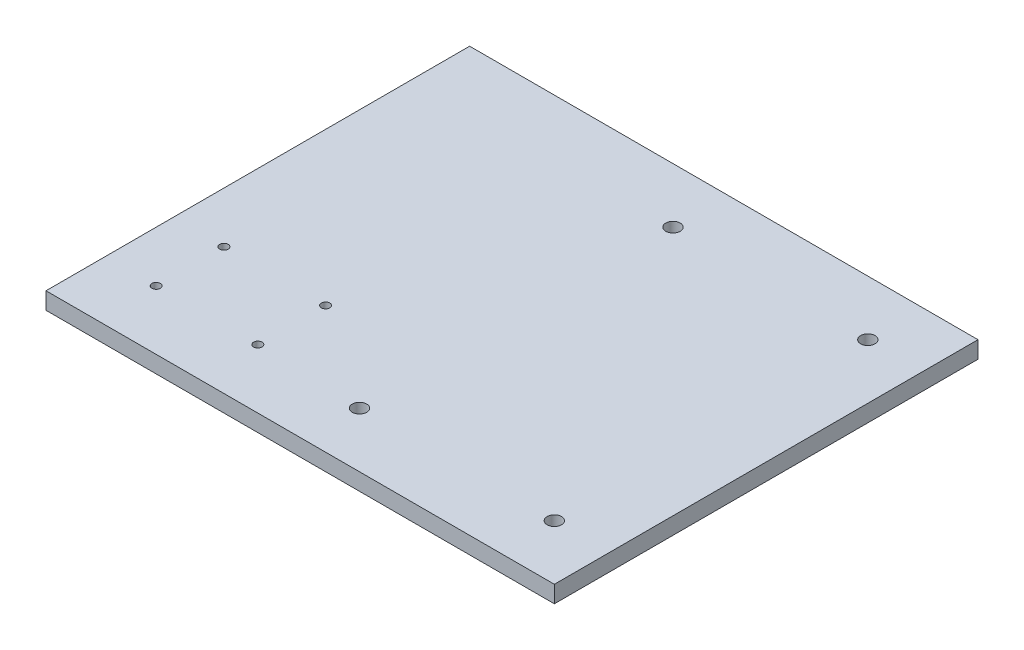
from build123d import *

# Parameters (mm, degrees)
SKETCH_1_W      = 300
SKETCH_1_H      = 250
EXTRUDE_1_DEPTH = 10
M6X1_0_2_D      = 5
M10X1_5_2_D     = 8.5


with BuildPart() as part:
    # Sketch 1 → Extrude 1 (new body)
    with BuildSketch(Plane(origin=(0, 0, 0), x_dir=(1, 0, 0), z_dir=(0, 1, 0))):
        with Locations((150, 125)):
            Rectangle(SKETCH_1_W, SKETCH_1_H)
    extrude(amount=EXTRUDE_1_DEPTH)

    # M6x1.0 _2 (through all)
    with Locations(Plane(origin=(0, 10, 0), x_dir=(-1, 0, 0), z_dir=(0, 1, 0))):
        with Locations((-90, -75), (-90, -35), (-30, -35), (-30, -75)):
            Hole(M6X1_0_2_D / 2)

    # M10x1.5 _2 (through all)
    with Locations(Plane(origin=(0, 10, 0), x_dir=(-1, 0, 0), z_dir=(0, 1, 0))):
        with Locations((-267.5, -217.5), (-152.5, -217.5), (-267.5, -32.5), (-152.5, -32.5)):
            Hole(M10X1_5_2_D / 2)


solid = part.part
